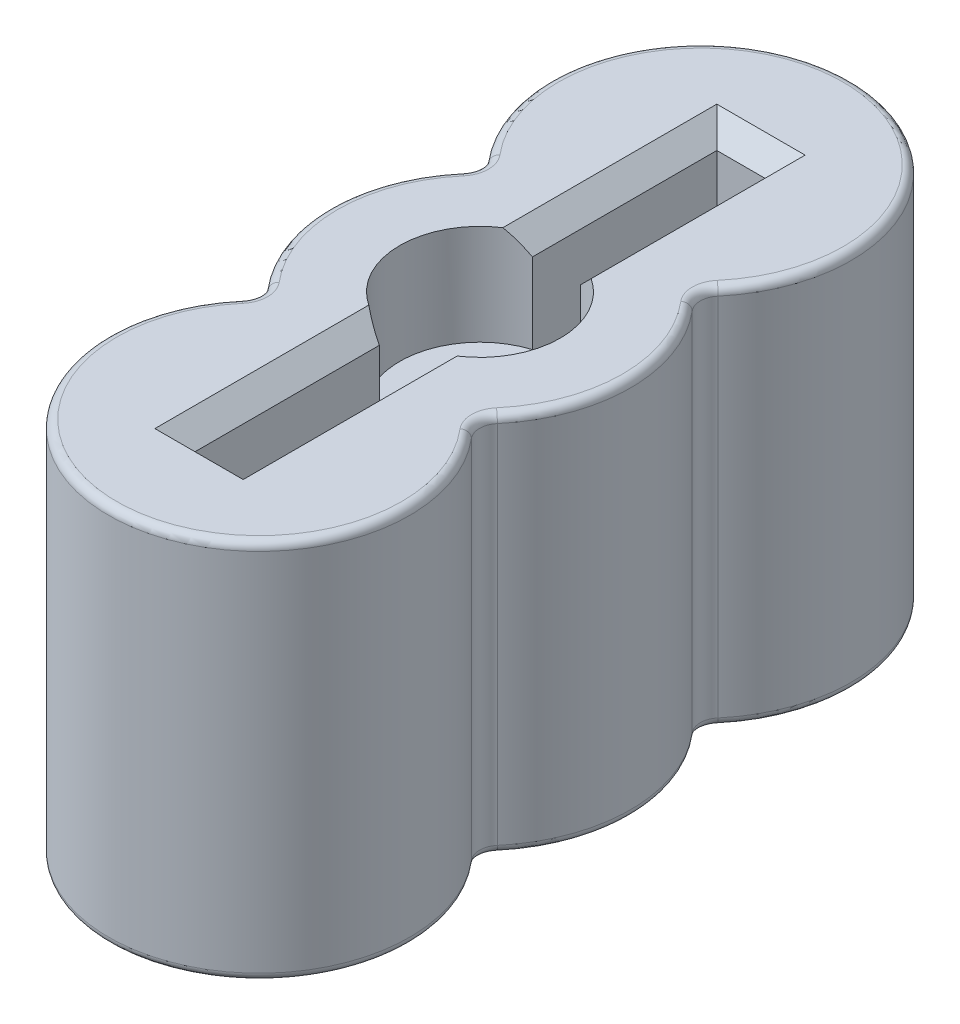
ISO-10303-21;
HEADER;
FILE_DESCRIPTION(('STEP AP214'),'2;1');
FILE_NAME('part.step','',(''),(''),'','','');
FILE_SCHEMA(('AUTOMOTIVE_DESIGN { 1 0 10303 214 1 1 1 1 }'));
ENDSEC;
DATA;
#1=APPLICATION_CONTEXT('core data for automotive mechanical design processes');
#2=APPLICATION_PROTOCOL_DEFINITION('international standard','automotive_design',2000,#1);
#3=PRODUCT_CONTEXT('',#1,'mechanical');
#4=PRODUCT('Part','Part','',(#3));
#5=PRODUCT_RELATED_PRODUCT_CATEGORY('part','',(#4));
#6=PRODUCT_DEFINITION_FORMATION('','',#4);
#7=PRODUCT_DEFINITION_CONTEXT('part definition',#1,'design');
#8=PRODUCT_DEFINITION('design','',#6,#7);
#9=PRODUCT_DEFINITION_SHAPE('','',#8);
#10=(LENGTH_UNIT() NAMED_UNIT(*) SI_UNIT(.MILLI.,.METRE.));
#11=(NAMED_UNIT(*) PLANE_ANGLE_UNIT() SI_UNIT($,.RADIAN.));
#12=(NAMED_UNIT(*) SI_UNIT($,.STERADIAN.) SOLID_ANGLE_UNIT());
#13=UNCERTAINTY_MEASURE_WITH_UNIT(LENGTH_MEASURE(1.E-05),#10,'distance_accuracy_value','');
#14=(GEOMETRIC_REPRESENTATION_CONTEXT(3) GLOBAL_UNCERTAINTY_ASSIGNED_CONTEXT((#13)) GLOBAL_UNIT_ASSIGNED_CONTEXT((#10,
#11,#12)) REPRESENTATION_CONTEXT('',''));
#15=CARTESIAN_POINT('',(0.,0.,0.));
#16=DIRECTION('',(0.,0.,1.));
#17=DIRECTION('',(1.,0.,0.));
#18=AXIS2_PLACEMENT_3D('',#15,#16,#17);
#19=CARTESIAN_POINT('',(0.,4.75,0.));
#20=DIRECTION('',(0.,-1.,0.));
#21=DIRECTION('',(0.,0.,-1.));
#22=AXIS2_PLACEMENT_3D('',#19,#20,#21);
#23=CYLINDRICAL_SURFACE('',#22,3.75);
#24=DIRECTION('',(0.,-1.,0.));
#25=VECTOR('',#24,1.);
#26=CARTESIAN_POINT('',(2.85915030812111,4.75,-2.42647058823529));
#27=LINE('',#26,#25);
#28=CARTESIAN_POINT('',(2.85915030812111,-4.55,-2.42647058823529));
#29=VERTEX_POINT('',#28);
#30=CARTESIAN_POINT('',(2.85915030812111,4.55,-2.42647058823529));
#31=VERTEX_POINT('',#30);
#32=EDGE_CURVE('E366',#29,#31,#27,.F.);
#33=ORIENTED_EDGE('',*,*,#32,.T.);
#34=CARTESIAN_POINT('',(0.,4.55,0.));
#35=DIRECTION('',(0.,-1.,0.));
#36=DIRECTION('',(0.,0.,-1.));
#37=AXIS2_PLACEMENT_3D('',#34,#35,#36);
#38=CIRCLE('',#37,3.75);
#39=CARTESIAN_POINT('',(2.85915030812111,4.55,2.42647058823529));
#40=VERTEX_POINT('',#39);
#41=EDGE_CURVE('E499',#31,#40,#38,.T.);
#42=ORIENTED_EDGE('',*,*,#41,.T.);
#43=DIRECTION('',(0.,-1.,0.));
#44=VECTOR('',#43,1.);
#45=CARTESIAN_POINT('',(2.85915030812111,4.75,2.42647058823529));
#46=LINE('',#45,#44);
#47=CARTESIAN_POINT('',(2.85915030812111,-4.55,2.42647058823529));
#48=VERTEX_POINT('',#47);
#49=EDGE_CURVE('E363',#40,#48,#46,.T.);
#50=ORIENTED_EDGE('',*,*,#49,.T.);
#51=CARTESIAN_POINT('',(0.,-4.55,0.));
#52=DIRECTION('',(0.,-1.,0.));
#53=DIRECTION('',(0.,0.,-1.));
#54=AXIS2_PLACEMENT_3D('',#51,#52,#53);
#55=CIRCLE('',#54,3.75);
#56=EDGE_CURVE('E497',#48,#29,#55,.F.);
#57=ORIENTED_EDGE('',*,*,#56,.T.);
#58=EDGE_LOOP('',(#33,#42,#50,#57));
#59=FACE_BOUND('',#58,.T.);
#60=ADVANCED_FACE('F35',(#59),#23,.T.);
#61=CARTESIAN_POINT('',(0.,4.75,5.5));
#62=DIRECTION('',(0.,-1.,0.));
#63=DIRECTION('',(0.,0.,-1.));
#64=AXIS2_PLACEMENT_3D('',#61,#62,#63);
#65=CYLINDRICAL_SURFACE('',#64,3.75);
#66=DIRECTION('',(0.,-1.,0.));
#67=VECTOR('',#66,1.);
#68=CARTESIAN_POINT('',(2.85915030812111,4.75,3.07352941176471));
#69=LINE('',#68,#67);
#70=CARTESIAN_POINT('',(2.85915030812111,-4.55,3.07352941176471));
#71=VERTEX_POINT('',#70);
#72=CARTESIAN_POINT('',(2.85915030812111,4.55,3.07352941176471));
#73=VERTEX_POINT('',#72);
#74=EDGE_CURVE('E343',#71,#73,#69,.F.);
#75=ORIENTED_EDGE('',*,*,#74,.T.);
#76=CARTESIAN_POINT('',(0.,4.55,5.5));
#77=DIRECTION('',(0.,-1.,0.));
#78=DIRECTION('',(0.,0.,-1.));
#79=AXIS2_PLACEMENT_3D('',#76,#77,#78);
#80=CIRCLE('',#79,3.75);
#81=CARTESIAN_POINT('',(-2.85915030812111,4.55,3.07352941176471));
#82=VERTEX_POINT('',#81);
#83=EDGE_CURVE('E465',#73,#82,#80,.T.);
#84=ORIENTED_EDGE('',*,*,#83,.T.);
#85=DIRECTION('',(0.,-1.,0.));
#86=VECTOR('',#85,1.);
#87=CARTESIAN_POINT('',(-2.85915030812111,4.75,3.07352941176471));
#88=LINE('',#87,#86);
#89=CARTESIAN_POINT('',(-2.85915030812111,-4.55,3.07352941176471));
#90=VERTEX_POINT('',#89);
#91=EDGE_CURVE('E354',#82,#90,#88,.T.);
#92=ORIENTED_EDGE('',*,*,#91,.T.);
#93=CARTESIAN_POINT('',(0.,-4.55,5.5));
#94=DIRECTION('',(0.,-1.,0.));
#95=DIRECTION('',(0.,0.,-1.));
#96=AXIS2_PLACEMENT_3D('',#93,#94,#95);
#97=CIRCLE('',#96,3.75);
#98=EDGE_CURVE('E442',#90,#71,#97,.F.);
#99=ORIENTED_EDGE('',*,*,#98,.T.);
#100=EDGE_LOOP('',(#75,#84,#92,#99));
#101=FACE_BOUND('',#100,.T.);
#102=ADVANCED_FACE('F596',(#101),#65,.T.);
#103=DIRECTION('',(0.,-1.,0.));
#104=VECTOR('',#103,1.);
#105=CARTESIAN_POINT('',(-2.85915030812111,4.75,2.42647058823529));
#106=LINE('',#105,#104);
#107=CARTESIAN_POINT('',(-2.85915030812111,-4.55,2.42647058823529));
#108=VERTEX_POINT('',#107);
#109=CARTESIAN_POINT('',(-2.85915030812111,4.55,2.42647058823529));
#110=VERTEX_POINT('',#109);
#111=EDGE_CURVE('E360',#108,#110,#106,.F.);
#112=ORIENTED_EDGE('',*,*,#111,.T.);
#113=CARTESIAN_POINT('',(0.,4.55,0.));
#114=DIRECTION('',(0.,-1.,0.));
#115=DIRECTION('',(0.,0.,-1.));
#116=AXIS2_PLACEMENT_3D('',#113,#114,#115);
#117=CIRCLE('',#116,3.75);
#118=CARTESIAN_POINT('',(-2.85915030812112,4.55,-2.42647058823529));
#119=VERTEX_POINT('',#118);
#120=EDGE_CURVE('E495',#110,#119,#117,.T.);
#121=ORIENTED_EDGE('',*,*,#120,.T.);
#122=DIRECTION('',(0.,-1.,0.));
#123=VECTOR('',#122,1.);
#124=CARTESIAN_POINT('',(-2.85915030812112,4.75,-2.42647058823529));
#125=LINE('',#124,#123);
#126=CARTESIAN_POINT('',(-2.85915030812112,-4.55,-2.42647058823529));
#127=VERTEX_POINT('',#126);
#128=EDGE_CURVE('E357',#119,#127,#125,.T.);
#129=ORIENTED_EDGE('',*,*,#128,.T.);
#130=CARTESIAN_POINT('',(0.,-4.55,0.));
#131=DIRECTION('',(0.,-1.,0.));
#132=DIRECTION('',(0.,0.,-1.));
#133=AXIS2_PLACEMENT_3D('',#130,#131,#132);
#134=CIRCLE('',#133,3.75);
#135=EDGE_CURVE('E493',#127,#108,#134,.F.);
#136=ORIENTED_EDGE('',*,*,#135,.T.);
#137=EDGE_LOOP('',(#112,#121,#129,#136));
#138=FACE_BOUND('',#137,.T.);
#139=ADVANCED_FACE('F664',(#138),#23,.T.);
#140=CARTESIAN_POINT('',(0.,4.75,2.75));
#141=DIRECTION('',(0.,-1.,0.));
#142=DIRECTION('',(0.,0.,-1.));
#143=AXIS2_PLACEMENT_3D('',#140,#141,#142);
#144=PLANE('',#143);
#145=CARTESIAN_POINT('',(-3.24037034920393,4.75,2.75));
#146=DIRECTION('',(0.,-1.,0.));
#147=DIRECTION('',(0.,0.,-1.));
#148=AXIS2_PLACEMENT_3D('',#145,#146,#147);
#149=CIRCLE('',#148,0.7);
#150=CARTESIAN_POINT('',(-2.70666229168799,4.75,2.29705882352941));
#151=VERTEX_POINT('',#150);
#152=CARTESIAN_POINT('',(-2.70666229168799,4.75,3.20294117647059));
#153=VERTEX_POINT('',#152);
#154=EDGE_CURVE('E480',#151,#153,#149,.T.);
#155=ORIENTED_EDGE('',*,*,#154,.T.);
#156=CARTESIAN_POINT('',(0.,4.75,5.5));
#157=DIRECTION('',(0.,-1.,0.));
#158=DIRECTION('',(0.,0.,-1.));
#159=AXIS2_PLACEMENT_3D('',#156,#157,#158);
#160=CIRCLE('',#159,3.55);
#161=CARTESIAN_POINT('',(2.70666229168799,4.75,3.20294117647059));
#162=VERTEX_POINT('',#161);
#163=EDGE_CURVE('E482',#153,#162,#160,.F.);
#164=ORIENTED_EDGE('',*,*,#163,.T.);
#165=CARTESIAN_POINT('',(3.24037034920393,4.75,2.75));
#166=DIRECTION('',(0.,-1.,0.));
#167=DIRECTION('',(0.,0.,-1.));
#168=AXIS2_PLACEMENT_3D('',#165,#166,#167);
#169=CIRCLE('',#168,0.7);
#170=CARTESIAN_POINT('',(2.70666229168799,4.75,2.29705882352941));
#171=VERTEX_POINT('',#170);
#172=EDGE_CURVE('E478',#162,#171,#169,.T.);
#173=ORIENTED_EDGE('',*,*,#172,.T.);
#174=CARTESIAN_POINT('',(0.,4.75,0.));
#175=DIRECTION('',(0.,-1.,0.));
#176=DIRECTION('',(0.,0.,-1.));
#177=AXIS2_PLACEMENT_3D('',#174,#175,#176);
#178=CIRCLE('',#177,3.55);
#179=CARTESIAN_POINT('',(2.70666229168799,4.75,-2.29705882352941));
#180=VERTEX_POINT('',#179);
#181=EDGE_CURVE('E474',#171,#180,#178,.F.);
#182=ORIENTED_EDGE('',*,*,#181,.T.);
#183=CARTESIAN_POINT('',(3.24037034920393,4.75,-2.75));
#184=DIRECTION('',(0.,-1.,0.));
#185=DIRECTION('',(0.,0.,-1.));
#186=AXIS2_PLACEMENT_3D('',#183,#184,#185);
#187=CIRCLE('',#186,0.7);
#188=CARTESIAN_POINT('',(2.70666229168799,4.75,-3.20294117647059));
#189=VERTEX_POINT('',#188);
#190=EDGE_CURVE('E470',#180,#189,#187,.T.);
#191=ORIENTED_EDGE('',*,*,#190,.T.);
#192=CARTESIAN_POINT('',(0.,4.75,-5.5));
#193=DIRECTION('',(0.,-1.,0.));
#194=DIRECTION('',(0.,0.,-1.));
#195=AXIS2_PLACEMENT_3D('',#192,#193,#194);
#196=CIRCLE('',#195,3.55);
#197=CARTESIAN_POINT('',(-2.70666229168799,4.75,-3.20294117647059));
#198=VERTEX_POINT('',#197);
#199=EDGE_CURVE('E468',#189,#198,#196,.F.);
#200=ORIENTED_EDGE('',*,*,#199,.T.);
#201=CARTESIAN_POINT('',(-3.24037034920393,4.75,-2.75));
#202=DIRECTION('',(0.,-1.,0.));
#203=DIRECTION('',(0.,0.,-1.));
#204=AXIS2_PLACEMENT_3D('',#201,#202,#203);
#205=CIRCLE('',#204,0.7);
#206=CARTESIAN_POINT('',(-2.70666229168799,4.75,-2.29705882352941));
#207=VERTEX_POINT('',#206);
#208=EDGE_CURVE('E472',#198,#207,#205,.T.);
#209=ORIENTED_EDGE('',*,*,#208,.T.);
#210=CARTESIAN_POINT('',(0.,4.75,0.));
#211=DIRECTION('',(0.,-1.,0.));
#212=DIRECTION('',(0.,0.,-1.));
#213=AXIS2_PLACEMENT_3D('',#210,#211,#212);
#214=CIRCLE('',#213,3.55);
#215=EDGE_CURVE('E476',#207,#151,#214,.F.);
#216=ORIENTED_EDGE('',*,*,#215,.T.);
#217=EDGE_LOOP('',(#155,#164,#173,#182,#191,#200,#209,#216));
#218=FACE_BOUND('',#217,.T.);
#219=DIRECTION('',(1.,0.,0.));
#220=VECTOR('',#219,1.);
#221=CARTESIAN_POINT('',(0.,4.75,-7.));
#222=LINE('',#221,#220);
#223=CARTESIAN_POINT('',(-1.1,4.75,-7.));
#224=VERTEX_POINT('',#223);
#225=CARTESIAN_POINT('',(1.1,4.75,-7.));
#226=VERTEX_POINT('',#225);
#227=EDGE_CURVE('E426',#224,#226,#222,.T.);
#228=ORIENTED_EDGE('',*,*,#227,.T.);
#229=DIRECTION('',(0.,0.,1.));
#230=VECTOR('',#229,1.);
#231=CARTESIAN_POINT('',(1.1,4.75,2.75));
#232=LINE('',#231,#230);
#233=CARTESIAN_POINT('',(1.1,4.75,-1.67032930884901));
#234=VERTEX_POINT('',#233);
#235=EDGE_CURVE('E428',#226,#234,#232,.T.);
#236=ORIENTED_EDGE('',*,*,#235,.T.);
#237=CARTESIAN_POINT('',(0.,4.75,0.));
#238=DIRECTION('',(0.,1.,0.));
#239=DIRECTION('',(0.,0.,1.));
#240=AXIS2_PLACEMENT_3D('',#237,#238,#239);
#241=CIRCLE('',#240,2.);
#242=CARTESIAN_POINT('',(1.1,4.75,1.67032930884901));
#243=VERTEX_POINT('',#242);
#244=EDGE_CURVE('E284',#243,#234,#241,.T.);
#245=ORIENTED_EDGE('',*,*,#244,.F.);
#246=DIRECTION('',(0.,0.,1.));
#247=VECTOR('',#246,1.);
#248=CARTESIAN_POINT('',(1.1,4.75,2.75));
#249=LINE('',#248,#247);
#250=CARTESIAN_POINT('',(1.1,4.75,6.99999999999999));
#251=VERTEX_POINT('',#250);
#252=EDGE_CURVE('E420',#243,#251,#249,.T.);
#253=ORIENTED_EDGE('',*,*,#252,.T.);
#254=DIRECTION('',(-1.,0.,0.));
#255=VECTOR('',#254,1.);
#256=CARTESIAN_POINT('',(0.,4.75,6.99999999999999));
#257=LINE('',#256,#255);
#258=CARTESIAN_POINT('',(-1.1,4.75,6.99999999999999));
#259=VERTEX_POINT('',#258);
#260=EDGE_CURVE('E418',#251,#259,#257,.T.);
#261=ORIENTED_EDGE('',*,*,#260,.T.);
#262=DIRECTION('',(0.,0.,-1.));
#263=VECTOR('',#262,1.);
#264=CARTESIAN_POINT('',(-1.1,4.75,2.75));
#265=LINE('',#264,#263);
#266=CARTESIAN_POINT('',(-1.1,4.75,1.67032930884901));
#267=VERTEX_POINT('',#266);
#268=EDGE_CURVE('E422',#259,#267,#265,.T.);
#269=ORIENTED_EDGE('',*,*,#268,.T.);
#270=CARTESIAN_POINT('',(0.,4.75,0.));
#271=DIRECTION('',(0.,1.,0.));
#272=DIRECTION('',(0.,0.,1.));
#273=AXIS2_PLACEMENT_3D('',#270,#271,#272);
#274=CIRCLE('',#273,2.);
#275=CARTESIAN_POINT('',(-1.1,4.75,-1.67032930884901));
#276=VERTEX_POINT('',#275);
#277=EDGE_CURVE('E310',#276,#267,#274,.T.);
#278=ORIENTED_EDGE('',*,*,#277,.F.);
#279=DIRECTION('',(0.,0.,-1.));
#280=VECTOR('',#279,1.);
#281=CARTESIAN_POINT('',(-1.1,4.75,2.75));
#282=LINE('',#281,#280);
#283=EDGE_CURVE('E424',#276,#224,#282,.T.);
#284=ORIENTED_EDGE('',*,*,#283,.T.);
#285=EDGE_LOOP('',(#228,#236,#245,#253,#261,#269,#278,#284));
#286=FACE_BOUND('',#285,.T.);
#287=ADVANCED_FACE('F643',(#218,#286),#144,.F.);
#288=CARTESIAN_POINT('',(0.,-4.75,2.75));
#289=DIRECTION('',(0.,-1.,0.));
#290=DIRECTION('',(0.,0.,-1.));
#291=AXIS2_PLACEMENT_3D('',#288,#289,#290);
#292=PLANE('',#291);
#293=CARTESIAN_POINT('',(0.,-4.75,0.));
#294=DIRECTION('',(0.,-1.,0.));
#295=DIRECTION('',(0.,0.,-1.));
#296=AXIS2_PLACEMENT_3D('',#293,#294,#295);
#297=CIRCLE('',#296,3.55);
#298=CARTESIAN_POINT('',(-2.70666229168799,-4.75,2.29705882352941));
#299=VERTEX_POINT('',#298);
#300=CARTESIAN_POINT('',(-2.70666229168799,-4.75,-2.29705882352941));
#301=VERTEX_POINT('',#300);
#302=EDGE_CURVE('E59',#299,#301,#297,.T.);
#303=ORIENTED_EDGE('',*,*,#302,.T.);
#304=CARTESIAN_POINT('',(-3.24037034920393,-4.75,-2.75));
#305=DIRECTION('',(0.,-1.,0.));
#306=DIRECTION('',(0.,0.,-1.));
#307=AXIS2_PLACEMENT_3D('',#304,#305,#306);
#308=CIRCLE('',#307,0.7);
#309=CARTESIAN_POINT('',(-2.70666229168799,-4.75,-3.20294117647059));
#310=VERTEX_POINT('',#309);
#311=EDGE_CURVE('E11',#301,#310,#308,.F.);
#312=ORIENTED_EDGE('',*,*,#311,.T.);
#313=CARTESIAN_POINT('',(0.,-4.75,-5.5));
#314=DIRECTION('',(0.,-1.,0.));
#315=DIRECTION('',(0.,0.,-1.));
#316=AXIS2_PLACEMENT_3D('',#313,#314,#315);
#317=CIRCLE('',#316,3.55);
#318=CARTESIAN_POINT('',(2.70666229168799,-4.75,-3.20294117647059));
#319=VERTEX_POINT('',#318);
#320=EDGE_CURVE('E44',#310,#319,#317,.T.);
#321=ORIENTED_EDGE('',*,*,#320,.T.);
#322=CARTESIAN_POINT('',(3.24037034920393,-4.75,-2.75));
#323=DIRECTION('',(0.,-1.,0.));
#324=DIRECTION('',(0.,0.,-1.));
#325=AXIS2_PLACEMENT_3D('',#322,#323,#324);
#326=CIRCLE('',#325,0.7);
#327=CARTESIAN_POINT('',(2.70666229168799,-4.75,-2.29705882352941));
#328=VERTEX_POINT('',#327);
#329=EDGE_CURVE('E522',#319,#328,#326,.F.);
#330=ORIENTED_EDGE('',*,*,#329,.T.);
#331=CARTESIAN_POINT('',(0.,-4.75,0.));
#332=DIRECTION('',(0.,-1.,0.));
#333=DIRECTION('',(0.,0.,-1.));
#334=AXIS2_PLACEMENT_3D('',#331,#332,#333);
#335=CIRCLE('',#334,3.55);
#336=CARTESIAN_POINT('',(2.70666229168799,-4.75,2.29705882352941));
#337=VERTEX_POINT('',#336);
#338=EDGE_CURVE('E518',#328,#337,#335,.T.);
#339=ORIENTED_EDGE('',*,*,#338,.T.);
#340=CARTESIAN_POINT('',(3.24037034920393,-4.75,2.75));
#341=DIRECTION('',(0.,-1.,0.));
#342=DIRECTION('',(0.,0.,-1.));
#343=AXIS2_PLACEMENT_3D('',#340,#341,#342);
#344=CIRCLE('',#343,0.7);
#345=CARTESIAN_POINT('',(2.70666229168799,-4.75,3.20294117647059));
#346=VERTEX_POINT('',#345);
#347=EDGE_CURVE('E514',#337,#346,#344,.F.);
#348=ORIENTED_EDGE('',*,*,#347,.T.);
#349=CARTESIAN_POINT('',(0.,-4.75,5.5));
#350=DIRECTION('',(0.,-1.,0.));
#351=DIRECTION('',(0.,0.,-1.));
#352=AXIS2_PLACEMENT_3D('',#349,#350,#351);
#353=CIRCLE('',#352,3.55);
#354=CARTESIAN_POINT('',(-2.70666229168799,-4.75,3.20294117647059));
#355=VERTEX_POINT('',#354);
#356=EDGE_CURVE('E516',#346,#355,#353,.T.);
#357=ORIENTED_EDGE('',*,*,#356,.T.);
#358=CARTESIAN_POINT('',(-3.24037034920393,-4.75,2.75));
#359=DIRECTION('',(0.,-1.,0.));
#360=DIRECTION('',(0.,0.,-1.));
#361=AXIS2_PLACEMENT_3D('',#358,#359,#360);
#362=CIRCLE('',#361,0.7);
#363=EDGE_CURVE('E520',#355,#299,#362,.F.);
#364=ORIENTED_EDGE('',*,*,#363,.T.);
#365=EDGE_LOOP('',(#303,#312,#321,#330,#339,#348,#357,#364));
#366=FACE_BOUND('',#365,.T.);
#367=CARTESIAN_POINT('',(0.,-4.75,0.));
#368=DIRECTION('',(0.,-1.,0.));
#369=DIRECTION('',(0.,0.,-1.));
#370=AXIS2_PLACEMENT_3D('',#367,#368,#369);
#371=CIRCLE('',#370,2.);
#372=CARTESIAN_POINT('',(1.09999999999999,-4.75,-1.67032930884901));
#373=VERTEX_POINT('',#372);
#374=CARTESIAN_POINT('',(1.09999999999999,-4.75,1.67032930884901));
#375=VERTEX_POINT('',#374);
#376=EDGE_CURVE('E294',#373,#375,#371,.T.);
#377=ORIENTED_EDGE('',*,*,#376,.F.);
#378=DIRECTION('',(0.,0.,-1.));
#379=VECTOR('',#378,1.);
#380=CARTESIAN_POINT('',(1.09999999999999,-4.75,-6.5));
#381=LINE('',#380,#379);
#382=CARTESIAN_POINT('',(1.09999999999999,-4.75,-6.99999999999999));
#383=VERTEX_POINT('',#382);
#384=EDGE_CURVE('E386',#373,#383,#381,.T.);
#385=ORIENTED_EDGE('',*,*,#384,.T.);
#386=DIRECTION('',(-1.,0.,0.));
#387=VECTOR('',#386,1.);
#388=CARTESIAN_POINT('',(-0.6,-4.75,-6.99999999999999));
#389=LINE('',#388,#387);
#390=CARTESIAN_POINT('',(-1.09999999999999,-4.75,-6.99999999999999));
#391=VERTEX_POINT('',#390);
#392=EDGE_CURVE('E384',#383,#391,#389,.T.);
#393=ORIENTED_EDGE('',*,*,#392,.T.);
#394=DIRECTION('',(0.,0.,1.));
#395=VECTOR('',#394,1.);
#396=CARTESIAN_POINT('',(-1.09999999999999,-4.75,-1.90787840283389));
#397=LINE('',#396,#395);
#398=CARTESIAN_POINT('',(-1.09999999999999,-4.75,-1.67032930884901));
#399=VERTEX_POINT('',#398);
#400=EDGE_CURVE('E382',#391,#399,#397,.T.);
#401=ORIENTED_EDGE('',*,*,#400,.T.);
#402=CARTESIAN_POINT('',(0.,-4.75,0.));
#403=DIRECTION('',(0.,-1.,0.));
#404=DIRECTION('',(0.,0.,-1.));
#405=AXIS2_PLACEMENT_3D('',#402,#403,#404);
#406=CIRCLE('',#405,2.);
#407=CARTESIAN_POINT('',(-1.09999999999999,-4.75,1.67032930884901));
#408=VERTEX_POINT('',#407);
#409=EDGE_CURVE('E324',#408,#399,#406,.T.);
#410=ORIENTED_EDGE('',*,*,#409,.F.);
#411=DIRECTION('',(0.,0.,1.));
#412=VECTOR('',#411,1.);
#413=CARTESIAN_POINT('',(-1.09999999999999,-4.75,6.5));
#414=LINE('',#413,#412);
#415=CARTESIAN_POINT('',(-1.09999999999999,-4.75,6.99999999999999));
#416=VERTEX_POINT('',#415);
#417=EDGE_CURVE('E379',#408,#416,#414,.T.);
#418=ORIENTED_EDGE('',*,*,#417,.T.);
#419=DIRECTION('',(1.,0.,0.));
#420=VECTOR('',#419,1.);
#421=CARTESIAN_POINT('',(0.6,-4.75,6.99999999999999));
#422=LINE('',#421,#420);
#423=CARTESIAN_POINT('',(1.09999999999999,-4.75,6.99999999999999));
#424=VERTEX_POINT('',#423);
#425=EDGE_CURVE('E377',#416,#424,#422,.T.);
#426=ORIENTED_EDGE('',*,*,#425,.T.);
#427=DIRECTION('',(0.,0.,-1.));
#428=VECTOR('',#427,1.);
#429=CARTESIAN_POINT('',(1.09999999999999,-4.75,1.90787840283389));
#430=LINE('',#429,#428);
#431=EDGE_CURVE('E375',#424,#375,#430,.T.);
#432=ORIENTED_EDGE('',*,*,#431,.T.);
#433=EDGE_LOOP('',(#377,#385,#393,#401,#410,#418,#426,#432));
#434=FACE_BOUND('',#433,.T.);
#435=ADVANCED_FACE('F611',(#366,#434),#292,.T.);
#436=CARTESIAN_POINT('',(0.,-4.75,-5.5));
#437=DIRECTION('',(0.,1.,0.));
#438=DIRECTION('',(0.,0.,1.));
#439=AXIS2_PLACEMENT_3D('',#436,#437,#438);
#440=CYLINDRICAL_SURFACE('',#439,3.75);
#441=DIRECTION('',(0.,1.,0.));
#442=VECTOR('',#441,1.);
#443=CARTESIAN_POINT('',(-2.85915030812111,-4.75,-3.0735294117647));
#444=LINE('',#443,#442);
#445=CARTESIAN_POINT('',(-2.85915030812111,-4.55,-3.0735294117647));
#446=VERTEX_POINT('',#445);
#447=CARTESIAN_POINT('',(-2.85915030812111,4.55,-3.0735294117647));
#448=VERTEX_POINT('',#447);
#449=EDGE_CURVE('E369',#446,#448,#444,.T.);
#450=ORIENTED_EDGE('',*,*,#449,.T.);
#451=CARTESIAN_POINT('',(0.,4.55,-5.5));
#452=DIRECTION('',(0.,-1.,0.));
#453=DIRECTION('',(0.,0.,-1.));
#454=AXIS2_PLACEMENT_3D('',#451,#452,#453);
#455=CIRCLE('',#454,3.75);
#456=CARTESIAN_POINT('',(2.85915030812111,4.55,-3.07352941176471));
#457=VERTEX_POINT('',#456);
#458=EDGE_CURVE('E512',#448,#457,#455,.T.);
#459=ORIENTED_EDGE('',*,*,#458,.T.);
#460=DIRECTION('',(0.,1.,0.));
#461=VECTOR('',#460,1.);
#462=CARTESIAN_POINT('',(2.85915030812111,-4.75,-3.07352941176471));
#463=LINE('',#462,#461);
#464=CARTESIAN_POINT('',(2.85915030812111,-4.55,-3.07352941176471));
#465=VERTEX_POINT('',#464);
#466=EDGE_CURVE('E372',#457,#465,#463,.F.);
#467=ORIENTED_EDGE('',*,*,#466,.T.);
#468=CARTESIAN_POINT('',(0.,-4.55,-5.5));
#469=DIRECTION('',(0.,-1.,0.));
#470=DIRECTION('',(0.,0.,-1.));
#471=AXIS2_PLACEMENT_3D('',#468,#469,#470);
#472=CIRCLE('',#471,3.75);
#473=EDGE_CURVE('E510',#465,#446,#472,.F.);
#474=ORIENTED_EDGE('',*,*,#473,.T.);
#475=EDGE_LOOP('',(#450,#459,#467,#474));
#476=FACE_BOUND('',#475,.T.);
#477=ADVANCED_FACE('F624',(#476),#440,.T.);
#478=CARTESIAN_POINT('',(0.6,-4.75,6.5));
#479=DIRECTION('',(1.,0.,0.));
#480=DIRECTION('',(0.,0.,-1.));
#481=AXIS2_PLACEMENT_3D('',#478,#479,#480);
#482=PLANE('',#481);
#483=DIRECTION('',(0.,1.,0.));
#484=VECTOR('',#483,1.);
#485=CARTESIAN_POINT('',(0.6,-4.75,-6.5));
#486=LINE('',#485,#484);
#487=CARTESIAN_POINT('',(0.6,-4.25,-6.5));
#488=VERTEX_POINT('',#487);
#489=CARTESIAN_POINT('',(0.6,4.25000000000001,-6.5));
#490=VERTEX_POINT('',#489);
#491=EDGE_CURVE('E338',#488,#490,#486,.T.);
#492=ORIENTED_EDGE('',*,*,#491,.F.);
#493=DIRECTION('',(0.,0.,1.));
#494=VECTOR('',#493,1.);
#495=CARTESIAN_POINT('',(0.6,-4.25,-1.90787840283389));
#496=LINE('',#495,#494);
#497=CARTESIAN_POINT('',(0.6,-4.25,-1.90787840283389));
#498=VERTEX_POINT('',#497);
#499=EDGE_CURVE('E395',#488,#498,#496,.T.);
#500=ORIENTED_EDGE('',*,*,#499,.T.);
#501=DIRECTION('',(0.,-1.,0.));
#502=VECTOR('',#501,1.);
#503=CARTESIAN_POINT('',(0.6,-2.25,-1.90787840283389));
#504=LINE('',#503,#502);
#505=CARTESIAN_POINT('',(0.6,-2.25,-1.90787840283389));
#506=VERTEX_POINT('',#505);
#507=EDGE_CURVE('E307',#506,#498,#504,.T.);
#508=ORIENTED_EDGE('',*,*,#507,.F.);
#509=DIRECTION('',(0.,0.,-1.));
#510=VECTOR('',#509,1.);
#511=CARTESIAN_POINT('',(0.6,-2.25,1.90787840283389));
#512=LINE('',#511,#510);
#513=CARTESIAN_POINT('',(0.6,-2.25,1.90787840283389));
#514=VERTEX_POINT('',#513);
#515=EDGE_CURVE('E303',#514,#506,#512,.T.);
#516=ORIENTED_EDGE('',*,*,#515,.F.);
#517=DIRECTION('',(0.,-1.,0.));
#518=VECTOR('',#517,1.);
#519=CARTESIAN_POINT('',(0.6,-2.25,1.90787840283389));
#520=LINE('',#519,#518);
#521=CARTESIAN_POINT('',(0.6,-4.25,1.90787840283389));
#522=VERTEX_POINT('',#521);
#523=EDGE_CURVE('E305',#514,#522,#520,.T.);
#524=ORIENTED_EDGE('',*,*,#523,.T.);
#525=DIRECTION('',(0.,0.,1.));
#526=VECTOR('',#525,1.);
#527=CARTESIAN_POINT('',(0.6,-4.25,6.5));
#528=LINE('',#527,#526);
#529=CARTESIAN_POINT('',(0.6,-4.25,6.5));
#530=VERTEX_POINT('',#529);
#531=EDGE_CURVE('E389',#522,#530,#528,.T.);
#532=ORIENTED_EDGE('',*,*,#531,.T.);
#533=DIRECTION('',(0.,1.,0.));
#534=VECTOR('',#533,1.);
#535=CARTESIAN_POINT('',(0.6,-4.75,6.5));
#536=LINE('',#535,#534);
#537=CARTESIAN_POINT('',(0.6,4.25000000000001,6.5));
#538=VERTEX_POINT('',#537);
#539=EDGE_CURVE('E341',#530,#538,#536,.T.);
#540=ORIENTED_EDGE('',*,*,#539,.T.);
#541=DIRECTION('',(0.,0.,-1.));
#542=VECTOR('',#541,1.);
#543=CARTESIAN_POINT('',(0.6,4.25000000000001,6.5));
#544=LINE('',#543,#542);
#545=CARTESIAN_POINT('',(0.6,4.25000000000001,1.90787840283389));
#546=VERTEX_POINT('',#545);
#547=EDGE_CURVE('E293',#538,#546,#544,.T.);
#548=ORIENTED_EDGE('',*,*,#547,.T.);
#549=DIRECTION('',(0.,1.,0.));
#550=VECTOR('',#549,1.);
#551=CARTESIAN_POINT('',(0.6,2.25,1.90787840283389));
#552=LINE('',#551,#550);
#553=CARTESIAN_POINT('',(0.6,2.25,1.90787840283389));
#554=VERTEX_POINT('',#553);
#555=EDGE_CURVE('E277',#554,#546,#552,.T.);
#556=ORIENTED_EDGE('',*,*,#555,.F.);
#557=DIRECTION('',(0.,0.,1.));
#558=VECTOR('',#557,1.);
#559=CARTESIAN_POINT('',(0.6,2.25,-1.90787840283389));
#560=LINE('',#559,#558);
#561=CARTESIAN_POINT('',(0.6,2.25,-1.90787840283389));
#562=VERTEX_POINT('',#561);
#563=EDGE_CURVE('E283',#562,#554,#560,.T.);
#564=ORIENTED_EDGE('',*,*,#563,.F.);
#565=DIRECTION('',(0.,1.,0.));
#566=VECTOR('',#565,1.);
#567=CARTESIAN_POINT('',(0.6,2.25,-1.90787840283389));
#568=LINE('',#567,#566);
#569=CARTESIAN_POINT('',(0.6,4.25000000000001,-1.90787840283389));
#570=VERTEX_POINT('',#569);
#571=EDGE_CURVE('E280',#562,#570,#568,.T.);
#572=ORIENTED_EDGE('',*,*,#571,.T.);
#573=DIRECTION('',(0.,0.,-1.));
#574=VECTOR('',#573,1.);
#575=CARTESIAN_POINT('',(0.6,4.25000000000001,6.5));
#576=LINE('',#575,#574);
#577=EDGE_CURVE('E392',#570,#490,#576,.T.);
#578=ORIENTED_EDGE('',*,*,#577,.T.);
#579=EDGE_LOOP('',(#492,#500,#508,#516,#524,#532,#540,#548,#556,#564,#572,#578));
#580=FACE_BOUND('',#579,.T.);
#581=ADVANCED_FACE('F290',(#580),#482,.F.);
#582=CARTESIAN_POINT('',(-0.6,-4.75,6.5));
#583=DIRECTION('',(0.,0.,1.));
#584=DIRECTION('',(1.,0.,0.));
#585=AXIS2_PLACEMENT_3D('',#582,#583,#584);
#586=PLANE('',#585);
#587=DIRECTION('',(0.,1.,0.));
#588=VECTOR('',#587,1.);
#589=CARTESIAN_POINT('',(-0.6,-4.75,6.5));
#590=LINE('',#589,#588);
#591=CARTESIAN_POINT('',(-0.6,-4.25,6.5));
#592=VERTEX_POINT('',#591);
#593=CARTESIAN_POINT('',(-0.6,4.25000000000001,6.5));
#594=VERTEX_POINT('',#593);
#595=EDGE_CURVE('E344',#592,#594,#590,.T.);
#596=ORIENTED_EDGE('',*,*,#595,.T.);
#597=DIRECTION('',(1.,0.,0.));
#598=VECTOR('',#597,1.);
#599=CARTESIAN_POINT('',(-0.6,4.25000000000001,6.5));
#600=LINE('',#599,#598);
#601=EDGE_CURVE('E440',#594,#538,#600,.T.);
#602=ORIENTED_EDGE('',*,*,#601,.T.);
#603=ORIENTED_EDGE('',*,*,#539,.F.);
#604=DIRECTION('',(-1.,0.,0.));
#605=VECTOR('',#604,1.);
#606=CARTESIAN_POINT('',(-0.6,-4.25,6.5));
#607=LINE('',#606,#605);
#608=EDGE_CURVE('E438',#530,#592,#607,.T.);
#609=ORIENTED_EDGE('',*,*,#608,.T.);
#610=EDGE_LOOP('',(#596,#602,#603,#609));
#611=FACE_BOUND('',#610,.T.);
#612=ADVANCED_FACE('F684',(#611),#586,.F.);
#613=CARTESIAN_POINT('',(-0.6,-4.75,-6.5));
#614=DIRECTION('',(-1.,0.,0.));
#615=DIRECTION('',(0.,0.,1.));
#616=AXIS2_PLACEMENT_3D('',#613,#614,#615);
#617=PLANE('',#616);
#618=DIRECTION('',(0.,-1.,0.));
#619=VECTOR('',#618,1.);
#620=CARTESIAN_POINT('',(-0.6,-2.25,-1.90787840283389));
#621=LINE('',#620,#619);
#622=CARTESIAN_POINT('',(-0.6,-2.25,-1.90787840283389));
#623=VERTEX_POINT('',#622);
#624=CARTESIAN_POINT('',(-0.6,-4.25,-1.90787840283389));
#625=VERTEX_POINT('',#624);
#626=EDGE_CURVE('E332',#623,#625,#621,.T.);
#627=ORIENTED_EDGE('',*,*,#626,.T.);
#628=DIRECTION('',(0.,0.,-1.));
#629=VECTOR('',#628,1.);
#630=CARTESIAN_POINT('',(-0.6,-4.25,-6.5));
#631=LINE('',#630,#629);
#632=CARTESIAN_POINT('',(-0.6,-4.25,-6.5));
#633=VERTEX_POINT('',#632);
#634=EDGE_CURVE('E416',#625,#633,#631,.T.);
#635=ORIENTED_EDGE('',*,*,#634,.T.);
#636=DIRECTION('',(0.,1.,0.));
#637=VECTOR('',#636,1.);
#638=CARTESIAN_POINT('',(-0.6,-4.75,-6.5));
#639=LINE('',#638,#637);
#640=CARTESIAN_POINT('',(-0.6,4.25000000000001,-6.5));
#641=VERTEX_POINT('',#640);
#642=EDGE_CURVE('E347',#633,#641,#639,.T.);
#643=ORIENTED_EDGE('',*,*,#642,.T.);
#644=DIRECTION('',(0.,0.,1.));
#645=VECTOR('',#644,1.);
#646=CARTESIAN_POINT('',(-0.6,4.25000000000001,-6.5));
#647=LINE('',#646,#645);
#648=CARTESIAN_POINT('',(-0.6,4.25000000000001,-1.90787840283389));
#649=VERTEX_POINT('',#648);
#650=EDGE_CURVE('E414',#641,#649,#647,.T.);
#651=ORIENTED_EDGE('',*,*,#650,.T.);
#652=DIRECTION('',(0.,1.,0.));
#653=VECTOR('',#652,1.);
#654=CARTESIAN_POINT('',(-0.6,2.25,-1.90787840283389));
#655=LINE('',#654,#653);
#656=CARTESIAN_POINT('',(-0.6,2.25,-1.90787840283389));
#657=VERTEX_POINT('',#656);
#658=EDGE_CURVE('E321',#657,#649,#655,.T.);
#659=ORIENTED_EDGE('',*,*,#658,.F.);
#660=DIRECTION('',(0.,0.,-1.));
#661=VECTOR('',#660,1.);
#662=CARTESIAN_POINT('',(-0.6,2.25,1.90787840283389));
#663=LINE('',#662,#661);
#664=CARTESIAN_POINT('',(-0.6,2.25,1.90787840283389));
#665=VERTEX_POINT('',#664);
#666=EDGE_CURVE('E315',#665,#657,#663,.T.);
#667=ORIENTED_EDGE('',*,*,#666,.F.);
#668=DIRECTION('',(0.,1.,0.));
#669=VECTOR('',#668,1.);
#670=CARTESIAN_POINT('',(-0.6,2.25,1.90787840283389));
#671=LINE('',#670,#669);
#672=CARTESIAN_POINT('',(-0.6,4.25000000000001,1.90787840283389));
#673=VERTEX_POINT('',#672);
#674=EDGE_CURVE('E318',#665,#673,#671,.T.);
#675=ORIENTED_EDGE('',*,*,#674,.T.);
#676=DIRECTION('',(0.,0.,1.));
#677=VECTOR('',#676,1.);
#678=CARTESIAN_POINT('',(-0.6,4.25000000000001,-6.5));
#679=LINE('',#678,#677);
#680=EDGE_CURVE('E411',#673,#594,#679,.T.);
#681=ORIENTED_EDGE('',*,*,#680,.T.);
#682=ORIENTED_EDGE('',*,*,#595,.F.);
#683=DIRECTION('',(0.,0.,-1.));
#684=VECTOR('',#683,1.);
#685=CARTESIAN_POINT('',(-0.6,-4.25,1.90787840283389));
#686=LINE('',#685,#684);
#687=CARTESIAN_POINT('',(-0.6,-4.25,1.90787840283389));
#688=VERTEX_POINT('',#687);
#689=EDGE_CURVE('E409',#592,#688,#686,.T.);
#690=ORIENTED_EDGE('',*,*,#689,.T.);
#691=DIRECTION('',(0.,-1.,0.));
#692=VECTOR('',#691,1.);
#693=CARTESIAN_POINT('',(-0.6,-2.25,1.90787840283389));
#694=LINE('',#693,#692);
#695=CARTESIAN_POINT('',(-0.6,-2.25,1.90787840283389));
#696=VERTEX_POINT('',#695);
#697=EDGE_CURVE('E335',#696,#688,#694,.T.);
#698=ORIENTED_EDGE('',*,*,#697,.F.);
#699=DIRECTION('',(0.,0.,1.));
#700=VECTOR('',#699,1.);
#701=CARTESIAN_POINT('',(-0.6,-2.25,-1.90787840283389));
#702=LINE('',#701,#700);
#703=EDGE_CURVE('E329',#623,#696,#702,.T.);
#704=ORIENTED_EDGE('',*,*,#703,.F.);
#705=EDGE_LOOP('',(#627,#635,#643,#651,#659,#667,#675,#681,#682,#690,#698,#704));
#706=FACE_BOUND('',#705,.T.);
#707=ADVANCED_FACE('F689',(#706),#617,.F.);
#708=CARTESIAN_POINT('',(0.6,-4.75,-6.5));
#709=DIRECTION('',(0.,0.,-1.));
#710=DIRECTION('',(-1.,0.,0.));
#711=AXIS2_PLACEMENT_3D('',#708,#709,#710);
#712=PLANE('',#711);
#713=ORIENTED_EDGE('',*,*,#642,.F.);
#714=DIRECTION('',(1.,0.,0.));
#715=VECTOR('',#714,1.);
#716=CARTESIAN_POINT('',(0.6,-4.25,-6.5));
#717=LINE('',#716,#715);
#718=EDGE_CURVE('E403',#633,#488,#717,.T.);
#719=ORIENTED_EDGE('',*,*,#718,.T.);
#720=ORIENTED_EDGE('',*,*,#491,.T.);
#721=DIRECTION('',(-1.,0.,0.));
#722=VECTOR('',#721,1.);
#723=CARTESIAN_POINT('',(0.6,4.25000000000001,-6.5));
#724=LINE('',#723,#722);
#725=EDGE_CURVE('E401',#490,#641,#724,.T.);
#726=ORIENTED_EDGE('',*,*,#725,.T.);
#727=EDGE_LOOP('',(#713,#719,#720,#726));
#728=FACE_BOUND('',#727,.T.);
#729=ADVANCED_FACE('F685',(#728),#712,.F.);
#730=CARTESIAN_POINT('',(0.,-2.25,0.));
#731=DIRECTION('',(0.,-1.,0.));
#732=DIRECTION('',(0.,0.,-1.));
#733=AXIS2_PLACEMENT_3D('',#730,#731,#732);
#734=CYLINDRICAL_SURFACE('',#733,2.);
#735=ORIENTED_EDGE('',*,*,#409,.T.);
#736=CARTESIAN_POINT('',(0.,-3.64999999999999,0.));
#737=DIRECTION('',(0.707106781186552,-0.707106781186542,0.));
#738=DIRECTION('',(-0.707106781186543,-0.707106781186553,0.));
#739=AXIS2_PLACEMENT_3D('',#736,#737,#738);
#740=ELLIPSE('',#739,2.82842712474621,2.);
#741=EDGE_CURVE('E407',#399,#625,#740,.T.);
#742=ORIENTED_EDGE('',*,*,#741,.T.);
#743=ORIENTED_EDGE('',*,*,#626,.F.);
#744=CARTESIAN_POINT('',(0.,-2.25,0.));
#745=DIRECTION('',(0.,-1.,0.));
#746=DIRECTION('',(0.,0.,-1.));
#747=AXIS2_PLACEMENT_3D('',#744,#745,#746);
#748=CIRCLE('',#747,2.);
#749=EDGE_CURVE('E327',#696,#623,#748,.T.);
#750=ORIENTED_EDGE('',*,*,#749,.F.);
#751=ORIENTED_EDGE('',*,*,#697,.T.);
#752=CARTESIAN_POINT('',(0.,-3.64999999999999,0.));
#753=DIRECTION('',(0.707106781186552,-0.707106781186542,0.));
#754=DIRECTION('',(-0.707106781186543,-0.707106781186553,0.));
#755=AXIS2_PLACEMENT_3D('',#752,#753,#754);
#756=ELLIPSE('',#755,2.82842712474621,2.);
#757=EDGE_CURVE('E405',#688,#408,#756,.T.);
#758=ORIENTED_EDGE('',*,*,#757,.T.);
#759=EDGE_LOOP('',(#735,#742,#743,#750,#751,#758));
#760=FACE_BOUND('',#759,.T.);
#761=ADVANCED_FACE('F688',(#760),#734,.F.);
#762=CARTESIAN_POINT('',(0.,-2.25,0.));
#763=DIRECTION('',(0.,-1.,0.));
#764=DIRECTION('',(0.,0.,-1.));
#765=AXIS2_PLACEMENT_3D('',#762,#763,#764);
#766=PLANE('',#765);
#767=ORIENTED_EDGE('',*,*,#749,.T.);
#768=ORIENTED_EDGE('',*,*,#703,.T.);
#769=EDGE_LOOP('',(#767,#768));
#770=FACE_BOUND('',#769,.T.);
#771=ADVANCED_FACE('F699',(#770),#766,.T.);
#772=CARTESIAN_POINT('',(0.,2.25,0.));
#773=DIRECTION('',(0.,1.,0.));
#774=DIRECTION('',(0.,0.,1.));
#775=AXIS2_PLACEMENT_3D('',#772,#773,#774);
#776=CYLINDRICAL_SURFACE('',#775,2.);
#777=ORIENTED_EDGE('',*,*,#658,.T.);
#778=CARTESIAN_POINT('',(0.,3.65000000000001,0.));
#779=DIRECTION('',(-0.707106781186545,-0.70710678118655,0.));
#780=DIRECTION('',(-0.70710678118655,0.707106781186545,0.));
#781=AXIS2_PLACEMENT_3D('',#778,#779,#780);
#782=ELLIPSE('',#781,2.82842712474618,2.);
#783=EDGE_CURVE('E436',#649,#276,#782,.F.);
#784=ORIENTED_EDGE('',*,*,#783,.T.);
#785=ORIENTED_EDGE('',*,*,#277,.T.);
#786=CARTESIAN_POINT('',(0.,3.65000000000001,0.));
#787=DIRECTION('',(-0.707106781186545,-0.70710678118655,0.));
#788=DIRECTION('',(-0.70710678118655,0.707106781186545,0.));
#789=AXIS2_PLACEMENT_3D('',#786,#787,#788);
#790=ELLIPSE('',#789,2.82842712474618,2.);
#791=EDGE_CURVE('E434',#267,#673,#790,.F.);
#792=ORIENTED_EDGE('',*,*,#791,.T.);
#793=ORIENTED_EDGE('',*,*,#674,.F.);
#794=CARTESIAN_POINT('',(0.,2.25,0.));
#795=DIRECTION('',(0.,1.,0.));
#796=DIRECTION('',(0.,0.,1.));
#797=AXIS2_PLACEMENT_3D('',#794,#795,#796);
#798=CIRCLE('',#797,2.);
#799=EDGE_CURVE('E313',#657,#665,#798,.T.);
#800=ORIENTED_EDGE('',*,*,#799,.F.);
#801=EDGE_LOOP('',(#777,#784,#785,#792,#793,#800));
#802=FACE_BOUND('',#801,.T.);
#803=ADVANCED_FACE('F703',(#802),#776,.F.);
#804=CARTESIAN_POINT('',(0.,2.25,0.));
#805=DIRECTION('',(0.,1.,0.));
#806=DIRECTION('',(0.,0.,1.));
#807=AXIS2_PLACEMENT_3D('',#804,#805,#806);
#808=PLANE('',#807);
#809=ORIENTED_EDGE('',*,*,#799,.T.);
#810=ORIENTED_EDGE('',*,*,#666,.T.);
#811=EDGE_LOOP('',(#809,#810));
#812=FACE_BOUND('',#811,.T.);
#813=ADVANCED_FACE('F707',(#812),#808,.T.);
#814=CARTESIAN_POINT('',(0.,-2.25,0.));
#815=DIRECTION('',(0.,-1.,0.));
#816=DIRECTION('',(0.,0.,-1.));
#817=AXIS2_PLACEMENT_3D('',#814,#815,#816);
#818=CYLINDRICAL_SURFACE('',#817,2.);
#819=ORIENTED_EDGE('',*,*,#507,.T.);
#820=CARTESIAN_POINT('',(0.,-3.64999999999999,0.));
#821=DIRECTION('',(-0.707106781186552,-0.707106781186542,0.));
#822=DIRECTION('',(0.707106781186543,-0.707106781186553,0.));
#823=AXIS2_PLACEMENT_3D('',#820,#821,#822);
#824=ELLIPSE('',#823,2.82842712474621,2.);
#825=EDGE_CURVE('E399',#498,#373,#824,.T.);
#826=ORIENTED_EDGE('',*,*,#825,.T.);
#827=ORIENTED_EDGE('',*,*,#376,.T.);
#828=CARTESIAN_POINT('',(0.,-3.64999999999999,0.));
#829=DIRECTION('',(-0.707106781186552,-0.707106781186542,0.));
#830=DIRECTION('',(0.707106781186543,-0.707106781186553,0.));
#831=AXIS2_PLACEMENT_3D('',#828,#829,#830);
#832=ELLIPSE('',#831,2.82842712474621,2.);
#833=EDGE_CURVE('E397',#375,#522,#832,.T.);
#834=ORIENTED_EDGE('',*,*,#833,.T.);
#835=ORIENTED_EDGE('',*,*,#523,.F.);
#836=CARTESIAN_POINT('',(0.,-2.25,0.));
#837=DIRECTION('',(0.,-1.,0.));
#838=DIRECTION('',(0.,0.,-1.));
#839=AXIS2_PLACEMENT_3D('',#836,#837,#838);
#840=CIRCLE('',#839,2.);
#841=EDGE_CURVE('E297',#506,#514,#840,.T.);
#842=ORIENTED_EDGE('',*,*,#841,.F.);
#843=EDGE_LOOP('',(#819,#826,#827,#834,#835,#842));
#844=FACE_BOUND('',#843,.T.);
#845=ADVANCED_FACE('F711',(#844),#818,.F.);
#846=CARTESIAN_POINT('',(0.,-2.25,0.));
#847=DIRECTION('',(0.,-1.,0.));
#848=DIRECTION('',(0.,0.,-1.));
#849=AXIS2_PLACEMENT_3D('',#846,#847,#848);
#850=PLANE('',#849);
#851=ORIENTED_EDGE('',*,*,#841,.T.);
#852=ORIENTED_EDGE('',*,*,#515,.T.);
#853=EDGE_LOOP('',(#851,#852));
#854=FACE_BOUND('',#853,.T.);
#855=ADVANCED_FACE('F715',(#854),#850,.T.);
#856=CARTESIAN_POINT('',(0.,2.25,0.));
#857=DIRECTION('',(0.,1.,0.));
#858=DIRECTION('',(0.,0.,1.));
#859=AXIS2_PLACEMENT_3D('',#856,#857,#858);
#860=CYLINDRICAL_SURFACE('',#859,2.);
#861=ORIENTED_EDGE('',*,*,#244,.T.);
#862=CARTESIAN_POINT('',(0.,3.65000000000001,0.));
#863=DIRECTION('',(0.707106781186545,-0.70710678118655,0.));
#864=DIRECTION('',(0.70710678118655,0.707106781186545,0.));
#865=AXIS2_PLACEMENT_3D('',#862,#863,#864);
#866=ELLIPSE('',#865,2.82842712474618,2.);
#867=EDGE_CURVE('E432',#234,#570,#866,.F.);
#868=ORIENTED_EDGE('',*,*,#867,.T.);
#869=ORIENTED_EDGE('',*,*,#571,.F.);
#870=CARTESIAN_POINT('',(0.,2.25,0.));
#871=DIRECTION('',(0.,1.,0.));
#872=DIRECTION('',(0.,0.,1.));
#873=AXIS2_PLACEMENT_3D('',#870,#871,#872);
#874=CIRCLE('',#873,2.);
#875=EDGE_CURVE('E272',#554,#562,#874,.T.);
#876=ORIENTED_EDGE('',*,*,#875,.F.);
#877=ORIENTED_EDGE('',*,*,#555,.T.);
#878=CARTESIAN_POINT('',(0.,3.65000000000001,0.));
#879=DIRECTION('',(0.707106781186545,-0.70710678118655,0.));
#880=DIRECTION('',(0.70710678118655,0.707106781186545,0.));
#881=AXIS2_PLACEMENT_3D('',#878,#879,#880);
#882=ELLIPSE('',#881,2.82842712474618,2.);
#883=EDGE_CURVE('E430',#546,#243,#882,.F.);
#884=ORIENTED_EDGE('',*,*,#883,.T.);
#885=EDGE_LOOP('',(#861,#868,#869,#876,#877,#884));
#886=FACE_BOUND('',#885,.T.);
#887=ADVANCED_FACE('F275',(#886),#860,.F.);
#888=CARTESIAN_POINT('',(0.,2.25,0.));
#889=DIRECTION('',(0.,1.,0.));
#890=DIRECTION('',(0.,0.,1.));
#891=AXIS2_PLACEMENT_3D('',#888,#889,#890);
#892=PLANE('',#891);
#893=ORIENTED_EDGE('',*,*,#875,.T.);
#894=ORIENTED_EDGE('',*,*,#563,.T.);
#895=EDGE_LOOP('',(#893,#894));
#896=FACE_BOUND('',#895,.T.);
#897=ADVANCED_FACE('F286',(#896),#892,.T.);
#898=CARTESIAN_POINT('',(-3.24037034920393,4.75,2.75));
#899=DIRECTION('',(0.,1.,0.));
#900=DIRECTION('',(0.,0.,1.));
#901=AXIS2_PLACEMENT_3D('',#898,#899,#900);
#902=CYLINDRICAL_SURFACE('',#901,0.5);
#903=ORIENTED_EDGE('',*,*,#91,.F.);
#904=CARTESIAN_POINT('',(-3.24037034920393,4.55,2.75));
#905=DIRECTION('',(0.,-1.,0.));
#906=DIRECTION('',(0.,0.,-1.));
#907=AXIS2_PLACEMENT_3D('',#904,#905,#906);
#908=CIRCLE('',#907,0.5);
#909=EDGE_CURVE('E487',#82,#110,#908,.F.);
#910=ORIENTED_EDGE('',*,*,#909,.T.);
#911=ORIENTED_EDGE('',*,*,#111,.F.);
#912=CARTESIAN_POINT('',(-3.24037034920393,-4.55,2.75));
#913=DIRECTION('',(0.,-1.,0.));
#914=DIRECTION('',(0.,0.,-1.));
#915=AXIS2_PLACEMENT_3D('',#912,#913,#914);
#916=CIRCLE('',#915,0.5);
#917=EDGE_CURVE('E485',#108,#90,#916,.T.);
#918=ORIENTED_EDGE('',*,*,#917,.T.);
#919=EDGE_LOOP('',(#903,#910,#911,#918));
#920=FACE_BOUND('',#919,.T.);
#921=ADVANCED_FACE('F599',(#920),#902,.F.);
#922=CARTESIAN_POINT('',(3.24037034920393,-4.75,-2.75));
#923=DIRECTION('',(0.,-1.,0.));
#924=DIRECTION('',(0.,0.,-1.));
#925=AXIS2_PLACEMENT_3D('',#922,#923,#924);
#926=CYLINDRICAL_SURFACE('',#925,0.5);
#927=ORIENTED_EDGE('',*,*,#466,.F.);
#928=CARTESIAN_POINT('',(3.24037034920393,4.55,-2.75));
#929=DIRECTION('',(0.,-1.,0.));
#930=DIRECTION('',(0.,0.,-1.));
#931=AXIS2_PLACEMENT_3D('',#928,#929,#930);
#932=CIRCLE('',#931,0.5);
#933=EDGE_CURVE('E508',#457,#31,#932,.F.);
#934=ORIENTED_EDGE('',*,*,#933,.T.);
#935=ORIENTED_EDGE('',*,*,#32,.F.);
#936=CARTESIAN_POINT('',(3.24037034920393,-4.55,-2.75));
#937=DIRECTION('',(0.,-1.,0.));
#938=DIRECTION('',(0.,0.,-1.));
#939=AXIS2_PLACEMENT_3D('',#936,#937,#938);
#940=CIRCLE('',#939,0.5);
#941=EDGE_CURVE('E506',#29,#465,#940,.T.);
#942=ORIENTED_EDGE('',*,*,#941,.T.);
#943=EDGE_LOOP('',(#927,#934,#935,#942));
#944=FACE_BOUND('',#943,.T.);
#945=ADVANCED_FACE('F653',(#944),#926,.F.);
#946=CARTESIAN_POINT('',(-3.24037034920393,4.75,-2.75));
#947=DIRECTION('',(0.,-1.,0.));
#948=DIRECTION('',(0.,0.,-1.));
#949=AXIS2_PLACEMENT_3D('',#946,#947,#948);
#950=CYLINDRICAL_SURFACE('',#949,0.5);
#951=ORIENTED_EDGE('',*,*,#128,.F.);
#952=CARTESIAN_POINT('',(-3.24037034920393,4.55,-2.75));
#953=DIRECTION('',(0.,-1.,0.));
#954=DIRECTION('',(0.,0.,-1.));
#955=AXIS2_PLACEMENT_3D('',#952,#953,#954);
#956=CIRCLE('',#955,0.5);
#957=EDGE_CURVE('E504',#119,#448,#956,.F.);
#958=ORIENTED_EDGE('',*,*,#957,.T.);
#959=ORIENTED_EDGE('',*,*,#449,.F.);
#960=CARTESIAN_POINT('',(-3.24037034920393,-4.55,-2.75));
#961=DIRECTION('',(0.,-1.,0.));
#962=DIRECTION('',(0.,0.,-1.));
#963=AXIS2_PLACEMENT_3D('',#960,#961,#962);
#964=CIRCLE('',#963,0.5);
#965=EDGE_CURVE('E501',#446,#127,#964,.T.);
#966=ORIENTED_EDGE('',*,*,#965,.T.);
#967=EDGE_LOOP('',(#951,#958,#959,#966));
#968=FACE_BOUND('',#967,.T.);
#969=ADVANCED_FACE('F629',(#968),#950,.F.);
#970=CARTESIAN_POINT('',(3.24037034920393,4.75,2.75));
#971=DIRECTION('',(0.,1.,0.));
#972=DIRECTION('',(0.,0.,1.));
#973=AXIS2_PLACEMENT_3D('',#970,#971,#972);
#974=CYLINDRICAL_SURFACE('',#973,0.5);
#975=ORIENTED_EDGE('',*,*,#49,.F.);
#976=CARTESIAN_POINT('',(3.24037034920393,4.55,2.75));
#977=DIRECTION('',(0.,-1.,0.));
#978=DIRECTION('',(0.,0.,-1.));
#979=AXIS2_PLACEMENT_3D('',#976,#977,#978);
#980=CIRCLE('',#979,0.5);
#981=EDGE_CURVE('E491',#40,#73,#980,.F.);
#982=ORIENTED_EDGE('',*,*,#981,.T.);
#983=ORIENTED_EDGE('',*,*,#74,.F.);
#984=CARTESIAN_POINT('',(3.24037034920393,-4.55,2.75));
#985=DIRECTION('',(0.,-1.,0.));
#986=DIRECTION('',(0.,0.,-1.));
#987=AXIS2_PLACEMENT_3D('',#984,#985,#986);
#988=CIRCLE('',#987,0.5);
#989=EDGE_CURVE('E489',#71,#48,#988,.T.);
#990=ORIENTED_EDGE('',*,*,#989,.T.);
#991=EDGE_LOOP('',(#975,#982,#983,#990));
#992=FACE_BOUND('',#991,.T.);
#993=ADVANCED_FACE('F580',(#992),#974,.F.);
#994=CARTESIAN_POINT('',(-1.09999999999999,-4.75,2.75));
#995=DIRECTION('',(0.707106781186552,-0.707106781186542,0.));
#996=DIRECTION('',(0.,0.,-1.));
#997=AXIS2_PLACEMENT_3D('',#994,#995,#996);
#998=PLANE('',#997);
#999=ORIENTED_EDGE('',*,*,#741,.F.);
#1000=ORIENTED_EDGE('',*,*,#400,.F.);
#1001=DIRECTION('',(0.577350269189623,0.577350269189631,0.577350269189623));
#1002=VECTOR('',#1001,1.);
#1003=CARTESIAN_POINT('',(-0.73333333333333,-4.38333333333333,-6.63333333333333));
#1004=LINE('',#1003,#1002);
#1005=EDGE_CURVE('E445',#633,#391,#1004,.F.);
#1006=ORIENTED_EDGE('',*,*,#1005,.F.);
#1007=ORIENTED_EDGE('',*,*,#634,.F.);
#1008=EDGE_LOOP('',(#999,#1000,#1006,#1007));
#1009=FACE_BOUND('',#1008,.T.);
#1010=ADVANCED_FACE('F736',(#1009),#998,.T.);
#1011=CARTESIAN_POINT('',(0.,-4.75,-6.99999999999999));
#1012=DIRECTION('',(0.,-0.707106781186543,0.707106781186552));
#1013=DIRECTION('',(1.,0.,0.));
#1014=AXIS2_PLACEMENT_3D('',#1011,#1012,#1013);
#1015=PLANE('',#1014);
#1016=ORIENTED_EDGE('',*,*,#1005,.T.);
#1017=ORIENTED_EDGE('',*,*,#392,.F.);
#1018=DIRECTION('',(-0.577350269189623,0.577350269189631,0.577350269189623));
#1019=VECTOR('',#1018,1.);
#1020=CARTESIAN_POINT('',(-2.14999999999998,-1.49999999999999,-3.75000000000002));
#1021=LINE('',#1020,#1019);
#1022=EDGE_CURVE('E443',#488,#383,#1021,.F.);
#1023=ORIENTED_EDGE('',*,*,#1022,.F.);
#1024=ORIENTED_EDGE('',*,*,#718,.F.);
#1025=EDGE_LOOP('',(#1016,#1017,#1023,#1024));
#1026=FACE_BOUND('',#1025,.T.);
#1027=ADVANCED_FACE('F741',(#1026),#1015,.T.);
#1028=CARTESIAN_POINT('',(1.09999999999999,-4.75,2.75));
#1029=DIRECTION('',(-0.707106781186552,-0.707106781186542,0.));
#1030=DIRECTION('',(0.,0.,1.));
#1031=AXIS2_PLACEMENT_3D('',#1028,#1029,#1030);
#1032=PLANE('',#1031);
#1033=ORIENTED_EDGE('',*,*,#825,.F.);
#1034=ORIENTED_EDGE('',*,*,#499,.F.);
#1035=ORIENTED_EDGE('',*,*,#1022,.T.);
#1036=ORIENTED_EDGE('',*,*,#384,.F.);
#1037=EDGE_LOOP('',(#1033,#1034,#1035,#1036));
#1038=FACE_BOUND('',#1037,.T.);
#1039=ADVANCED_FACE('F737',(#1038),#1032,.T.);
#1040=CARTESIAN_POINT('',(-0.6,4.25000000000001,-6.5));
#1041=DIRECTION('',(-0.707106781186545,-0.70710678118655,0.));
#1042=DIRECTION('',(0.,0.,1.));
#1043=AXIS2_PLACEMENT_3D('',#1040,#1041,#1042);
#1044=PLANE('',#1043);
#1045=ORIENTED_EDGE('',*,*,#783,.F.);
#1046=ORIENTED_EDGE('',*,*,#650,.F.);
#1047=DIRECTION('',(-0.577350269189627,0.577350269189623,-0.577350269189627));
#1048=VECTOR('',#1047,1.);
#1049=CARTESIAN_POINT('',(-0.199999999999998,3.85000000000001,-6.1));
#1050=LINE('',#1049,#1048);
#1051=EDGE_CURVE('E446',#224,#641,#1050,.F.);
#1052=ORIENTED_EDGE('',*,*,#1051,.F.);
#1053=ORIENTED_EDGE('',*,*,#283,.F.);
#1054=EDGE_LOOP('',(#1045,#1046,#1052,#1053));
#1055=FACE_BOUND('',#1054,.T.);
#1056=ADVANCED_FACE('F740',(#1055),#1044,.F.);
#1057=CARTESIAN_POINT('',(0.6,4.25000000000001,-6.5));
#1058=DIRECTION('',(0.,-0.70710678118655,-0.707106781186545));
#1059=DIRECTION('',(-1.,0.,0.));
#1060=AXIS2_PLACEMENT_3D('',#1057,#1058,#1059);
#1061=PLANE('',#1060);
#1062=ORIENTED_EDGE('',*,*,#1051,.T.);
#1063=ORIENTED_EDGE('',*,*,#725,.F.);
#1064=DIRECTION('',(0.577350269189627,0.577350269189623,-0.577350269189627));
#1065=VECTOR('',#1064,1.);
#1066=CARTESIAN_POINT('',(-3.73333333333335,-0.083333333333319,-2.16666666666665));
#1067=LINE('',#1066,#1065);
#1068=EDGE_CURVE('E449',#226,#490,#1067,.F.);
#1069=ORIENTED_EDGE('',*,*,#1068,.F.);
#1070=ORIENTED_EDGE('',*,*,#227,.F.);
#1071=EDGE_LOOP('',(#1062,#1063,#1069,#1070));
#1072=FACE_BOUND('',#1071,.T.);
#1073=ADVANCED_FACE('F753',(#1072),#1061,.F.);
#1074=CARTESIAN_POINT('',(0.6,4.25000000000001,6.5));
#1075=DIRECTION('',(0.707106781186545,-0.70710678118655,0.));
#1076=DIRECTION('',(0.,0.,-1.));
#1077=AXIS2_PLACEMENT_3D('',#1074,#1075,#1076);
#1078=PLANE('',#1077);
#1079=ORIENTED_EDGE('',*,*,#867,.F.);
#1080=ORIENTED_EDGE('',*,*,#235,.F.);
#1081=ORIENTED_EDGE('',*,*,#1068,.T.);
#1082=ORIENTED_EDGE('',*,*,#577,.F.);
#1083=EDGE_LOOP('',(#1079,#1080,#1081,#1082));
#1084=FACE_BOUND('',#1083,.T.);
#1085=ADVANCED_FACE('F749',(#1084),#1078,.F.);
#1086=CARTESIAN_POINT('',(0.6,4.25000000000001,6.5));
#1087=DIRECTION('',(0.707106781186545,-0.70710678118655,0.));
#1088=DIRECTION('',(0.,0.,-1.));
#1089=AXIS2_PLACEMENT_3D('',#1086,#1087,#1088);
#1090=PLANE('',#1089);
#1091=ORIENTED_EDGE('',*,*,#883,.F.);
#1092=ORIENTED_EDGE('',*,*,#547,.F.);
#1093=DIRECTION('',(-0.577350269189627,-0.577350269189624,-0.577350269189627));
#1094=VECTOR('',#1093,1.);
#1095=CARTESIAN_POINT('',(0.6,4.25000000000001,6.5));
#1096=LINE('',#1095,#1094);
#1097=EDGE_CURVE('E451',#251,#538,#1096,.T.);
#1098=ORIENTED_EDGE('',*,*,#1097,.F.);
#1099=ORIENTED_EDGE('',*,*,#252,.F.);
#1100=EDGE_LOOP('',(#1091,#1092,#1098,#1099));
#1101=FACE_BOUND('',#1100,.T.);
#1102=ADVANCED_FACE('F752',(#1101),#1090,.F.);
#1103=CARTESIAN_POINT('',(-0.6,4.25000000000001,6.5));
#1104=DIRECTION('',(0.,-0.707106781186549,0.707106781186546));
#1105=DIRECTION('',(1.,0.,0.));
#1106=AXIS2_PLACEMENT_3D('',#1103,#1104,#1105);
#1107=PLANE('',#1106);
#1108=ORIENTED_EDGE('',*,*,#1097,.T.);
#1109=ORIENTED_EDGE('',*,*,#601,.F.);
#1110=DIRECTION('',(-0.577350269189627,0.577350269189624,0.577350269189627));
#1111=VECTOR('',#1110,1.);
#1112=CARTESIAN_POINT('',(3.73333333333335,-0.0833333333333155,2.16666666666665));
#1113=LINE('',#1112,#1111);
#1114=EDGE_CURVE('E454',#259,#594,#1113,.F.);
#1115=ORIENTED_EDGE('',*,*,#1114,.F.);
#1116=ORIENTED_EDGE('',*,*,#260,.F.);
#1117=EDGE_LOOP('',(#1108,#1109,#1115,#1116));
#1118=FACE_BOUND('',#1117,.T.);
#1119=ADVANCED_FACE('F765',(#1118),#1107,.F.);
#1120=CARTESIAN_POINT('',(-0.6,4.25000000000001,-6.5));
#1121=DIRECTION('',(-0.707106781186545,-0.70710678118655,0.));
#1122=DIRECTION('',(0.,0.,1.));
#1123=AXIS2_PLACEMENT_3D('',#1120,#1121,#1122);
#1124=PLANE('',#1123);
#1125=ORIENTED_EDGE('',*,*,#791,.F.);
#1126=ORIENTED_EDGE('',*,*,#268,.F.);
#1127=ORIENTED_EDGE('',*,*,#1114,.T.);
#1128=ORIENTED_EDGE('',*,*,#680,.F.);
#1129=EDGE_LOOP('',(#1125,#1126,#1127,#1128));
#1130=FACE_BOUND('',#1129,.T.);
#1131=ADVANCED_FACE('F761',(#1130),#1124,.F.);
#1132=CARTESIAN_POINT('',(1.09999999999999,-4.75,2.75));
#1133=DIRECTION('',(-0.707106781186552,-0.707106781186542,0.));
#1134=DIRECTION('',(0.,0.,1.));
#1135=AXIS2_PLACEMENT_3D('',#1132,#1133,#1134);
#1136=PLANE('',#1135);
#1137=ORIENTED_EDGE('',*,*,#833,.F.);
#1138=ORIENTED_EDGE('',*,*,#431,.F.);
#1139=DIRECTION('',(-0.577350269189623,0.577350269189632,-0.577350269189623));
#1140=VECTOR('',#1139,1.);
#1141=CARTESIAN_POINT('',(0.73333333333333,-4.38333333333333,6.63333333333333));
#1142=LINE('',#1141,#1140);
#1143=EDGE_CURVE('E456',#530,#424,#1142,.F.);
#1144=ORIENTED_EDGE('',*,*,#1143,.F.);
#1145=ORIENTED_EDGE('',*,*,#531,.F.);
#1146=EDGE_LOOP('',(#1137,#1138,#1144,#1145));
#1147=FACE_BOUND('',#1146,.T.);
#1148=ADVANCED_FACE('F764',(#1147),#1136,.T.);
#1149=CARTESIAN_POINT('',(0.,-4.75,6.99999999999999));
#1150=DIRECTION('',(0.,-0.707106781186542,-0.707106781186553));
#1151=DIRECTION('',(-1.,0.,0.));
#1152=AXIS2_PLACEMENT_3D('',#1149,#1150,#1151);
#1153=PLANE('',#1152);
#1154=ORIENTED_EDGE('',*,*,#1143,.T.);
#1155=ORIENTED_EDGE('',*,*,#425,.F.);
#1156=DIRECTION('',(0.577350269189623,0.577350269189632,-0.577350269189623));
#1157=VECTOR('',#1156,1.);
#1158=CARTESIAN_POINT('',(0.316666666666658,-3.33333333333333,5.58333333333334));
#1159=LINE('',#1158,#1157);
#1160=EDGE_CURVE('E459',#592,#416,#1159,.F.);
#1161=ORIENTED_EDGE('',*,*,#1160,.F.);
#1162=ORIENTED_EDGE('',*,*,#608,.F.);
#1163=EDGE_LOOP('',(#1154,#1155,#1161,#1162));
#1164=FACE_BOUND('',#1163,.T.);
#1165=ADVANCED_FACE('F776',(#1164),#1153,.T.);
#1166=CARTESIAN_POINT('',(-1.09999999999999,-4.75,2.75));
#1167=DIRECTION('',(0.707106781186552,-0.707106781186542,0.));
#1168=DIRECTION('',(0.,0.,-1.));
#1169=AXIS2_PLACEMENT_3D('',#1166,#1167,#1168);
#1170=PLANE('',#1169);
#1171=ORIENTED_EDGE('',*,*,#757,.F.);
#1172=ORIENTED_EDGE('',*,*,#689,.F.);
#1173=ORIENTED_EDGE('',*,*,#1160,.T.);
#1174=ORIENTED_EDGE('',*,*,#417,.F.);
#1175=EDGE_LOOP('',(#1171,#1172,#1173,#1174));
#1176=FACE_BOUND('',#1175,.T.);
#1177=ADVANCED_FACE('F773',(#1176),#1170,.T.);
#1178=CARTESIAN_POINT('',(0.,4.55,-5.5));
#1179=DIRECTION('',(0.,-1.,0.));
#1180=DIRECTION('',(0.,0.,-1.));
#1181=AXIS2_PLACEMENT_3D('',#1178,#1179,#1180);
#1182=TOROIDAL_SURFACE('',#1181,3.55,0.2);
#1183=CARTESIAN_POINT('',(-2.70666229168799,4.55,-3.20294117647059));
#1184=DIRECTION('',(0.647058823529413,0.,0.762440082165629));
#1185=DIRECTION('',(0.762440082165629,0.,-0.647058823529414));
#1186=AXIS2_PLACEMENT_3D('',#1183,#1184,#1185);
#1187=CIRCLE('',#1186,0.2);
#1188=EDGE_CURVE('E542',#198,#448,#1187,.T.);
#1189=ORIENTED_EDGE('',*,*,#1188,.F.);
#1190=ORIENTED_EDGE('',*,*,#199,.F.);
#1191=CARTESIAN_POINT('',(2.70666229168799,4.55,-3.20294117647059));
#1192=DIRECTION('',(-0.647058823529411,0.,0.762440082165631));
#1193=DIRECTION('',(0.762440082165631,0.,0.647058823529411));
#1194=AXIS2_PLACEMENT_3D('',#1191,#1192,#1193);
#1195=CIRCLE('',#1194,0.2);
#1196=EDGE_CURVE('E461',#457,#189,#1195,.T.);
#1197=ORIENTED_EDGE('',*,*,#1196,.F.);
#1198=ORIENTED_EDGE('',*,*,#458,.F.);
#1199=EDGE_LOOP('',(#1189,#1190,#1197,#1198));
#1200=FACE_BOUND('',#1199,.T.);
#1201=ADVANCED_FACE('F650',(#1200),#1182,.T.);
#1202=CARTESIAN_POINT('',(3.24037034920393,4.55,-2.75));
#1203=DIRECTION('',(0.,-1.,0.));
#1204=DIRECTION('',(0.,0.,-1.));
#1205=AXIS2_PLACEMENT_3D('',#1202,#1203,#1204);
#1206=TOROIDAL_SURFACE('',#1205,0.7,0.2);
#1207=ORIENTED_EDGE('',*,*,#1196,.T.);
#1208=ORIENTED_EDGE('',*,*,#190,.F.);
#1209=CARTESIAN_POINT('',(2.70666229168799,4.55,-2.29705882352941));
#1210=DIRECTION('',(0.647058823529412,0.,0.76244008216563));
#1211=DIRECTION('',(0.76244008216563,0.,-0.647058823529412));
#1212=AXIS2_PLACEMENT_3D('',#1209,#1210,#1211);
#1213=CIRCLE('',#1212,0.2);
#1214=EDGE_CURVE('E539',#31,#180,#1213,.T.);
#1215=ORIENTED_EDGE('',*,*,#1214,.F.);
#1216=ORIENTED_EDGE('',*,*,#933,.F.);
#1217=EDGE_LOOP('',(#1207,#1208,#1215,#1216));
#1218=FACE_BOUND('',#1217,.T.);
#1219=ADVANCED_FACE('F800',(#1218),#1206,.T.);
#1220=CARTESIAN_POINT('',(-3.24037034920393,4.55,-2.75));
#1221=DIRECTION('',(0.,-1.,0.));
#1222=DIRECTION('',(0.,0.,-1.));
#1223=AXIS2_PLACEMENT_3D('',#1220,#1221,#1222);
#1224=TOROIDAL_SURFACE('',#1223,0.7,0.2);
#1225=ORIENTED_EDGE('',*,*,#1188,.T.);
#1226=ORIENTED_EDGE('',*,*,#957,.F.);
#1227=CARTESIAN_POINT('',(-2.70666229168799,4.55,-2.29705882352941));
#1228=DIRECTION('',(-0.647058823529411,0.,0.762440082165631));
#1229=DIRECTION('',(0.762440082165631,0.,0.647058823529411));
#1230=AXIS2_PLACEMENT_3D('',#1227,#1228,#1229);
#1231=CIRCLE('',#1230,0.2);
#1232=EDGE_CURVE('E536',#207,#119,#1231,.T.);
#1233=ORIENTED_EDGE('',*,*,#1232,.F.);
#1234=ORIENTED_EDGE('',*,*,#208,.F.);
#1235=EDGE_LOOP('',(#1225,#1226,#1233,#1234));
#1236=FACE_BOUND('',#1235,.T.);
#1237=ADVANCED_FACE('F633',(#1236),#1224,.T.);
#1238=CARTESIAN_POINT('',(0.,4.55,0.));
#1239=DIRECTION('',(0.,-1.,0.));
#1240=DIRECTION('',(0.,0.,-1.));
#1241=AXIS2_PLACEMENT_3D('',#1238,#1239,#1240);
#1242=TOROIDAL_SURFACE('',#1241,3.55,0.2);
#1243=ORIENTED_EDGE('',*,*,#1214,.T.);
#1244=ORIENTED_EDGE('',*,*,#181,.F.);
#1245=CARTESIAN_POINT('',(2.70666229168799,4.55,2.29705882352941));
#1246=DIRECTION('',(-0.647058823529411,0.,0.762440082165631));
#1247=DIRECTION('',(0.762440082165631,0.,0.647058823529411));
#1248=AXIS2_PLACEMENT_3D('',#1245,#1246,#1247);
#1249=CIRCLE('',#1248,0.2);
#1250=EDGE_CURVE('E533',#40,#171,#1249,.T.);
#1251=ORIENTED_EDGE('',*,*,#1250,.F.);
#1252=ORIENTED_EDGE('',*,*,#41,.F.);
#1253=EDGE_LOOP('',(#1243,#1244,#1251,#1252));
#1254=FACE_BOUND('',#1253,.T.);
#1255=ADVANCED_FACE('F587',(#1254),#1242,.T.);
#1256=CARTESIAN_POINT('',(0.,4.55,0.));
#1257=DIRECTION('',(0.,-1.,0.));
#1258=DIRECTION('',(0.,0.,-1.));
#1259=AXIS2_PLACEMENT_3D('',#1256,#1257,#1258);
#1260=TOROIDAL_SURFACE('',#1259,3.55,0.2);
#1261=ORIENTED_EDGE('',*,*,#1232,.T.);
#1262=ORIENTED_EDGE('',*,*,#120,.F.);
#1263=CARTESIAN_POINT('',(-2.70666229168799,4.55,2.29705882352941));
#1264=DIRECTION('',(0.647058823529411,0.,0.762440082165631));
#1265=DIRECTION('',(0.762440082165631,0.,-0.647058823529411));
#1266=AXIS2_PLACEMENT_3D('',#1263,#1264,#1265);
#1267=CIRCLE('',#1266,0.2);
#1268=EDGE_CURVE('E530',#151,#110,#1267,.T.);
#1269=ORIENTED_EDGE('',*,*,#1268,.F.);
#1270=ORIENTED_EDGE('',*,*,#215,.F.);
#1271=EDGE_LOOP('',(#1261,#1262,#1269,#1270));
#1272=FACE_BOUND('',#1271,.T.);
#1273=ADVANCED_FACE('F639',(#1272),#1260,.T.);
#1274=CARTESIAN_POINT('',(3.24037034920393,4.55,2.75));
#1275=DIRECTION('',(0.,-1.,0.));
#1276=DIRECTION('',(0.,0.,-1.));
#1277=AXIS2_PLACEMENT_3D('',#1274,#1275,#1276);
#1278=TOROIDAL_SURFACE('',#1277,0.7,0.2);
#1279=ORIENTED_EDGE('',*,*,#1250,.T.);
#1280=ORIENTED_EDGE('',*,*,#172,.F.);
#1281=CARTESIAN_POINT('',(2.70666229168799,4.55,3.20294117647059));
#1282=DIRECTION('',(0.647058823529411,0.,0.762440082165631));
#1283=DIRECTION('',(0.762440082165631,0.,-0.647058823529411));
#1284=AXIS2_PLACEMENT_3D('',#1281,#1282,#1283);
#1285=CIRCLE('',#1284,0.2);
#1286=EDGE_CURVE('E528',#73,#162,#1285,.T.);
#1287=ORIENTED_EDGE('',*,*,#1286,.F.);
#1288=ORIENTED_EDGE('',*,*,#981,.F.);
#1289=EDGE_LOOP('',(#1279,#1280,#1287,#1288));
#1290=FACE_BOUND('',#1289,.T.);
#1291=ADVANCED_FACE('F593',(#1290),#1278,.T.);
#1292=CARTESIAN_POINT('',(-3.24037034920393,4.55,2.75));
#1293=DIRECTION('',(0.,-1.,0.));
#1294=DIRECTION('',(0.,0.,-1.));
#1295=AXIS2_PLACEMENT_3D('',#1292,#1293,#1294);
#1296=TOROIDAL_SURFACE('',#1295,0.7,0.2);
#1297=ORIENTED_EDGE('',*,*,#1268,.T.);
#1298=ORIENTED_EDGE('',*,*,#909,.F.);
#1299=CARTESIAN_POINT('',(-2.70666229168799,4.55,3.20294117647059));
#1300=DIRECTION('',(-0.647058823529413,0.,0.762440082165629));
#1301=DIRECTION('',(0.762440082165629,0.,0.647058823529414));
#1302=AXIS2_PLACEMENT_3D('',#1299,#1300,#1301);
#1303=CIRCLE('',#1302,0.2);
#1304=EDGE_CURVE('E526',#153,#82,#1303,.T.);
#1305=ORIENTED_EDGE('',*,*,#1304,.F.);
#1306=ORIENTED_EDGE('',*,*,#154,.F.);
#1307=EDGE_LOOP('',(#1297,#1298,#1305,#1306));
#1308=FACE_BOUND('',#1307,.T.);
#1309=ADVANCED_FACE('F787',(#1308),#1296,.T.);
#1310=CARTESIAN_POINT('',(0.,4.55,5.5));
#1311=DIRECTION('',(0.,-1.,0.));
#1312=DIRECTION('',(0.,0.,-1.));
#1313=AXIS2_PLACEMENT_3D('',#1310,#1311,#1312);
#1314=TOROIDAL_SURFACE('',#1313,3.55,0.2);
#1315=ORIENTED_EDGE('',*,*,#1286,.T.);
#1316=ORIENTED_EDGE('',*,*,#163,.F.);
#1317=ORIENTED_EDGE('',*,*,#1304,.T.);
#1318=ORIENTED_EDGE('',*,*,#83,.F.);
#1319=EDGE_LOOP('',(#1315,#1316,#1317,#1318));
#1320=FACE_BOUND('',#1319,.T.);
#1321=ADVANCED_FACE('F784',(#1320),#1314,.T.);
#1322=CARTESIAN_POINT('',(3.24037034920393,-4.55,2.75));
#1323=DIRECTION('',(0.,-1.,0.));
#1324=DIRECTION('',(0.,0.,-1.));
#1325=AXIS2_PLACEMENT_3D('',#1322,#1323,#1324);
#1326=TOROIDAL_SURFACE('',#1325,0.7,0.2);
#1327=CARTESIAN_POINT('',(2.70666229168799,-4.55,2.29705882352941));
#1328=DIRECTION('',(0.647058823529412,0.,-0.76244008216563));
#1329=DIRECTION('',(-0.76244008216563,0.,-0.647058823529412));
#1330=AXIS2_PLACEMENT_3D('',#1327,#1328,#1329);
#1331=CIRCLE('',#1330,0.2);
#1332=EDGE_CURVE('E561',#48,#337,#1331,.T.);
#1333=ORIENTED_EDGE('',*,*,#1332,.F.);
#1334=ORIENTED_EDGE('',*,*,#989,.F.);
#1335=CARTESIAN_POINT('',(2.70666229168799,-4.55,3.20294117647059));
#1336=DIRECTION('',(0.647058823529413,0.,0.762440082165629));
#1337=DIRECTION('',(0.762440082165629,0.,-0.647058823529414));
#1338=AXIS2_PLACEMENT_3D('',#1335,#1336,#1337);
#1339=CIRCLE('',#1338,0.2);
#1340=EDGE_CURVE('E39',#346,#71,#1339,.T.);
#1341=ORIENTED_EDGE('',*,*,#1340,.F.);
#1342=ORIENTED_EDGE('',*,*,#347,.F.);
#1343=EDGE_LOOP('',(#1333,#1334,#1341,#1342));
#1344=FACE_BOUND('',#1343,.T.);
#1345=ADVANCED_FACE('F37',(#1344),#1326,.T.);
#1346=CARTESIAN_POINT('',(0.,-4.55,5.5));
#1347=DIRECTION('',(0.,-1.,0.));
#1348=DIRECTION('',(0.,0.,-1.));
#1349=AXIS2_PLACEMENT_3D('',#1346,#1347,#1348);
#1350=TOROIDAL_SURFACE('',#1349,3.55,0.2);
#1351=ORIENTED_EDGE('',*,*,#1340,.T.);
#1352=ORIENTED_EDGE('',*,*,#98,.F.);
#1353=CARTESIAN_POINT('',(-2.70666229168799,-4.55,3.20294117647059));
#1354=DIRECTION('',(0.647058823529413,0.,-0.762440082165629));
#1355=DIRECTION('',(-0.762440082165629,0.,-0.647058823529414));
#1356=AXIS2_PLACEMENT_3D('',#1353,#1354,#1355);
#1357=CIRCLE('',#1356,0.2);
#1358=EDGE_CURVE('E559',#355,#90,#1357,.T.);
#1359=ORIENTED_EDGE('',*,*,#1358,.F.);
#1360=ORIENTED_EDGE('',*,*,#356,.F.);
#1361=EDGE_LOOP('',(#1351,#1352,#1359,#1360));
#1362=FACE_BOUND('',#1361,.T.);
#1363=ADVANCED_FACE('F572',(#1362),#1350,.T.);
#1364=CARTESIAN_POINT('',(0.,-4.55,0.));
#1365=DIRECTION('',(0.,-1.,0.));
#1366=DIRECTION('',(0.,0.,-1.));
#1367=AXIS2_PLACEMENT_3D('',#1364,#1365,#1366);
#1368=TOROIDAL_SURFACE('',#1367,3.55,0.2);
#1369=ORIENTED_EDGE('',*,*,#1332,.T.);
#1370=ORIENTED_EDGE('',*,*,#338,.F.);
#1371=CARTESIAN_POINT('',(2.70666229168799,-4.55,-2.29705882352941));
#1372=DIRECTION('',(-0.647058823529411,0.,-0.762440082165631));
#1373=DIRECTION('',(-0.762440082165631,0.,0.647058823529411));
#1374=AXIS2_PLACEMENT_3D('',#1371,#1372,#1373);
#1375=CIRCLE('',#1374,0.2);
#1376=EDGE_CURVE('E556',#29,#328,#1375,.T.);
#1377=ORIENTED_EDGE('',*,*,#1376,.F.);
#1378=ORIENTED_EDGE('',*,*,#56,.F.);
#1379=EDGE_LOOP('',(#1369,#1370,#1377,#1378));
#1380=FACE_BOUND('',#1379,.T.);
#1381=ADVANCED_FACE('F654',(#1380),#1368,.T.);
#1382=CARTESIAN_POINT('',(-3.24037034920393,-4.55,2.75));
#1383=DIRECTION('',(0.,-1.,0.));
#1384=DIRECTION('',(0.,0.,-1.));
#1385=AXIS2_PLACEMENT_3D('',#1382,#1383,#1384);
#1386=TOROIDAL_SURFACE('',#1385,0.7,0.2);
#1387=ORIENTED_EDGE('',*,*,#1358,.T.);
#1388=ORIENTED_EDGE('',*,*,#917,.F.);
#1389=CARTESIAN_POINT('',(-2.70666229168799,-4.55,2.29705882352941));
#1390=DIRECTION('',(-0.647058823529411,0.,-0.762440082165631));
#1391=DIRECTION('',(-0.762440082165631,0.,0.647058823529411));
#1392=AXIS2_PLACEMENT_3D('',#1389,#1390,#1391);
#1393=CIRCLE('',#1392,0.2);
#1394=EDGE_CURVE('E553',#299,#108,#1393,.T.);
#1395=ORIENTED_EDGE('',*,*,#1394,.F.);
#1396=ORIENTED_EDGE('',*,*,#363,.F.);
#1397=EDGE_LOOP('',(#1387,#1388,#1395,#1396));
#1398=FACE_BOUND('',#1397,.T.);
#1399=ADVANCED_FACE('F605',(#1398),#1386,.T.);
#1400=CARTESIAN_POINT('',(3.24037034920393,-4.55,-2.75));
#1401=DIRECTION('',(0.,-1.,0.));
#1402=DIRECTION('',(0.,0.,-1.));
#1403=AXIS2_PLACEMENT_3D('',#1400,#1401,#1402);
#1404=TOROIDAL_SURFACE('',#1403,0.7,0.2);
#1405=ORIENTED_EDGE('',*,*,#1376,.T.);
#1406=ORIENTED_EDGE('',*,*,#329,.F.);
#1407=CARTESIAN_POINT('',(2.70666229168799,-4.55,-3.20294117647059));
#1408=DIRECTION('',(0.647058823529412,0.,-0.76244008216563));
#1409=DIRECTION('',(-0.76244008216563,0.,-0.647058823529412));
#1410=AXIS2_PLACEMENT_3D('',#1407,#1408,#1409);
#1411=CIRCLE('',#1410,0.2);
#1412=EDGE_CURVE('E550',#465,#319,#1411,.T.);
#1413=ORIENTED_EDGE('',*,*,#1412,.F.);
#1414=ORIENTED_EDGE('',*,*,#941,.F.);
#1415=EDGE_LOOP('',(#1405,#1406,#1413,#1414));
#1416=FACE_BOUND('',#1415,.T.);
#1417=ADVANCED_FACE('F617',(#1416),#1404,.T.);
#1418=CARTESIAN_POINT('',(0.,-4.55,0.));
#1419=DIRECTION('',(0.,-1.,0.));
#1420=DIRECTION('',(0.,0.,-1.));
#1421=AXIS2_PLACEMENT_3D('',#1418,#1419,#1420);
#1422=TOROIDAL_SURFACE('',#1421,3.55,0.2);
#1423=ORIENTED_EDGE('',*,*,#1394,.T.);
#1424=ORIENTED_EDGE('',*,*,#135,.F.);
#1425=CARTESIAN_POINT('',(-2.70666229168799,-4.55,-2.29705882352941));
#1426=DIRECTION('',(0.647058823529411,0.,-0.762440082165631));
#1427=DIRECTION('',(-0.762440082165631,0.,-0.647058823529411));
#1428=AXIS2_PLACEMENT_3D('',#1425,#1426,#1427);
#1429=CIRCLE('',#1428,0.2);
#1430=EDGE_CURVE('E548',#301,#127,#1429,.T.);
#1431=ORIENTED_EDGE('',*,*,#1430,.F.);
#1432=ORIENTED_EDGE('',*,*,#302,.F.);
#1433=EDGE_LOOP('',(#1423,#1424,#1431,#1432));
#1434=FACE_BOUND('',#1433,.T.);
#1435=ADVANCED_FACE('F609',(#1434),#1422,.T.);
#1436=CARTESIAN_POINT('',(0.,-4.55,-5.5));
#1437=DIRECTION('',(0.,-1.,0.));
#1438=DIRECTION('',(0.,0.,-1.));
#1439=AXIS2_PLACEMENT_3D('',#1436,#1437,#1438);
#1440=TOROIDAL_SURFACE('',#1439,3.55,0.2);
#1441=ORIENTED_EDGE('',*,*,#1412,.T.);
#1442=ORIENTED_EDGE('',*,*,#320,.F.);
#1443=CARTESIAN_POINT('',(-2.70666229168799,-4.55,-3.20294117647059));
#1444=DIRECTION('',(0.647058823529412,0.,0.76244008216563));
#1445=DIRECTION('',(0.76244008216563,0.,-0.647058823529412));
#1446=AXIS2_PLACEMENT_3D('',#1443,#1444,#1445);
#1447=CIRCLE('',#1446,0.2);
#1448=EDGE_CURVE('E52',#446,#310,#1447,.T.);
#1449=ORIENTED_EDGE('',*,*,#1448,.F.);
#1450=ORIENTED_EDGE('',*,*,#473,.F.);
#1451=EDGE_LOOP('',(#1441,#1442,#1449,#1450));
#1452=FACE_BOUND('',#1451,.T.);
#1453=ADVANCED_FACE('F621',(#1452),#1440,.T.);
#1454=CARTESIAN_POINT('',(-3.24037034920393,-4.55,-2.75));
#1455=DIRECTION('',(0.,-1.,0.));
#1456=DIRECTION('',(0.,0.,-1.));
#1457=AXIS2_PLACEMENT_3D('',#1454,#1455,#1456);
#1458=TOROIDAL_SURFACE('',#1457,0.7,0.2);
#1459=ORIENTED_EDGE('',*,*,#1430,.T.);
#1460=ORIENTED_EDGE('',*,*,#965,.F.);
#1461=ORIENTED_EDGE('',*,*,#1448,.T.);
#1462=ORIENTED_EDGE('',*,*,#311,.F.);
#1463=EDGE_LOOP('',(#1459,#1460,#1461,#1462));
#1464=FACE_BOUND('',#1463,.T.);
#1465=ADVANCED_FACE('F610',(#1464),#1458,.T.);
#1466=CLOSED_SHELL('',(#60,#102,#139,#287,#435,#477,#581,#612,#707,#729,#761,#771,#803,#813,
#845,#855,#887,#897,#921,#945,#969,#993,#1010,#1027,#1039,#1056,#1073,#1085,#1102,#1119,#1131,
#1148,#1165,#1177,#1201,#1219,#1237,#1255,#1273,#1291,#1309,#1321,#1345,#1363,#1381,#1399,#1417,
#1435,#1453,#1465));
#1467=MANIFOLD_SOLID_BREP('B2',#1466);
#1468=ADVANCED_BREP_SHAPE_REPRESENTATION('',(#18,#1467),#14);
#1469=SHAPE_DEFINITION_REPRESENTATION(#9,#1468);
ENDSEC;
END-ISO-10303-21;
